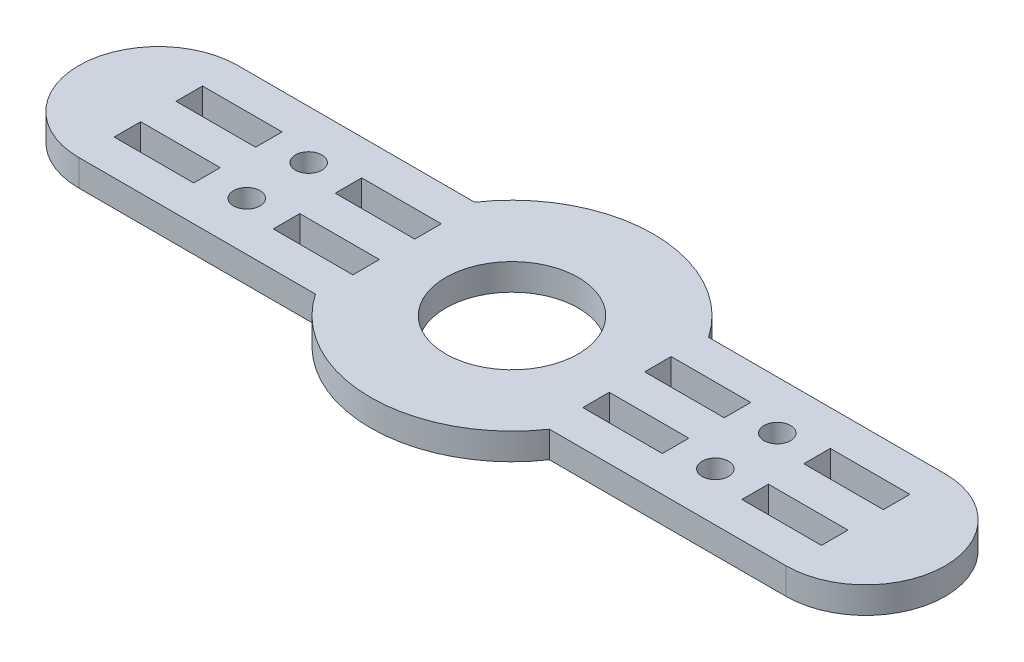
from build123d import *

# Parameters (mm, degrees)
SKETCH1_W           = 9
SKETCH1_H           = 3
SKETCH1_R           = 1.5
SKETCH1_R_2         = 7.5
BOSS_EXTRUDE1_DEPTH = 3


with BuildPart() as part:
    # Sketch1 → Boss-Extrude1 (new body)
    with BuildSketch(Plane(origin=(0, 0, 0), x_dir=(1, 0, 0), z_dir=(0, 1, 0))):
        with BuildLine():
            Line((-13.228756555, 9), (-40, 9))
            ThreePointArc((-40, 9), (-49, 0), (-40, -9))
            Line((-40, -9), (-13.228756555, -9))
            ThreePointArc((-13.228756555, -9), (0, -16), (13.228756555, -9))
            Line((13.228756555, -9), (40, -9))
            ThreePointArc((40, -9), (49, 0), (40, 9))
            Line((40, 9), (13.228756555, 9))
            ThreePointArc((13.228756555, 9), (0, 16), (-13.228756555, 9))
        make_face()
        with Locations((-35.5, -3.5)):
            Rectangle(SKETCH1_W, SKETCH1_H, mode=Mode.SUBTRACT)
        with Locations(Location((-26.5, -3.5, 0), (0, 0, 270))):
            Circle(SKETCH1_R, mode=Mode.SUBTRACT)
        with Locations((-17.5, -3.5)):
            Rectangle(SKETCH1_W, SKETCH1_H, mode=Mode.SUBTRACT)
        with Locations((17.5, -3.5)):
            Rectangle(SKETCH1_W, SKETCH1_H, mode=Mode.SUBTRACT)
        with Locations(Location((26.5, -3.5, 0), (0, 0, 270))):
            Circle(SKETCH1_R, mode=Mode.SUBTRACT)
        with Locations((35.5, -3.5)):
            Rectangle(SKETCH1_W, SKETCH1_H, mode=Mode.SUBTRACT)
        with Locations((-35.5, 3.5)):
            Rectangle(SKETCH1_W, SKETCH1_H, mode=Mode.SUBTRACT)
        with Locations(Location((-26.5, 3.5, 0), (0, 0, 270))):
            Circle(SKETCH1_R, mode=Mode.SUBTRACT)
        with Locations((-17.5, 3.5)):
            Rectangle(SKETCH1_W, SKETCH1_H, mode=Mode.SUBTRACT)
        with Locations(Location((0, 0, 0), (0, 0, 270))):
            Circle(SKETCH1_R_2, mode=Mode.SUBTRACT)
        with Locations((17.5, 3.5)):
            Rectangle(SKETCH1_W, SKETCH1_H, mode=Mode.SUBTRACT)
        with Locations(Location((26.5, 3.5, 0), (0, 0, 270))):
            Circle(SKETCH1_R, mode=Mode.SUBTRACT)
        with Locations((35.5, 3.5)):
            Rectangle(SKETCH1_W, SKETCH1_H, mode=Mode.SUBTRACT)
    extrude(amount=BOSS_EXTRUDE1_DEPTH)


solid = part.part
